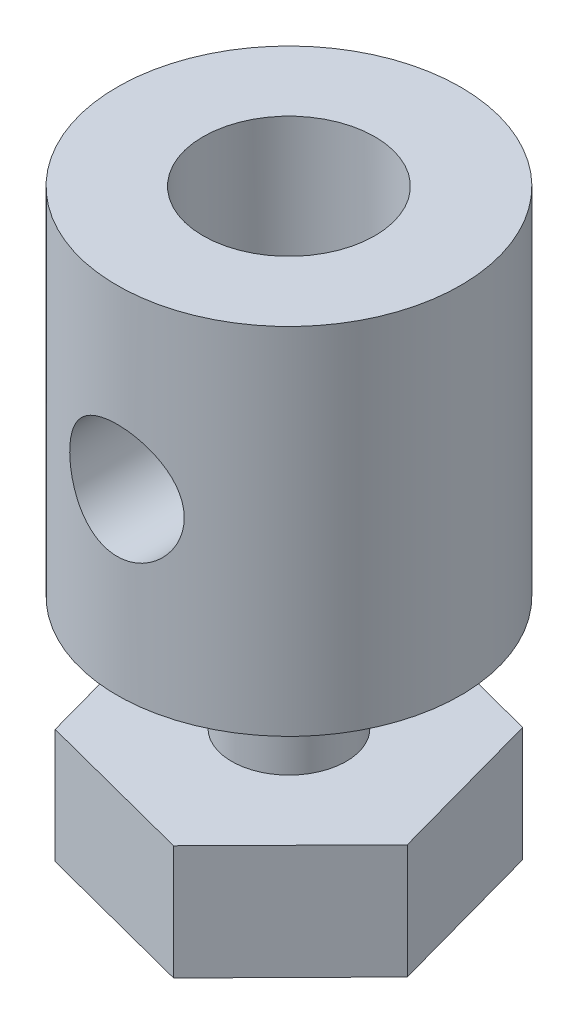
from build123d import *

# Parameters (mm, degrees)
ENL_V_MAT_EXTRU_1_DEPTH      = 12.976643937
ENL_V_MAT_EXTRU_1_DEPTH_BACK = 12.976643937
ESQUISSE2_R                  = 1
BOSS_EXTRU_1_DEPTH           = 2


with BuildPart() as part:
    # Esquisse1 → R_volution1 (revolve)
    with BuildSketch(Plane.XY, mode=Mode.PRIVATE) as r_volution1_sk:
        Polygon((0, 0), (0, 7.2), (1.5, 7.2), (1.5, 11.2), (3, 11.2), (3, 5), (1, 5), (1, 0), align=None)
    revolve(r_volution1_sk.sketch.rotate(Axis((0, 0, 0), (0, 1, 0)), 90), axis=Axis((0, 0, 0), (0, 1, 0)))

    # Esquisse2 → Enl_v. mat.-Extru.1 (cut, two sides: drawn at the far end of the back side and taken through both)
    with BuildSketch(Plane.XY.offset(-ENL_V_MAT_EXTRU_1_DEPTH_BACK)):
        with Locations((0, 8.1)):
            Circle(ESQUISSE2_R)
    extrude(amount=ENL_V_MAT_EXTRU_1_DEPTH + ENL_V_MAT_EXTRU_1_DEPTH_BACK, mode=Mode.SUBTRACT)

    # Esquisse3 → Boss.-Extru.1 (add)
    with BuildSketch(Plane.XZ.offset(-3)):
        Polygon((2.793775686, 0.72673981), (0.767512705, 2.782850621), (-2.02626298, 2.056110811), (-2.793775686, -0.72673981), (-0.767512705, -2.782850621), (2.02626298, -2.056110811), align=None)
    extrude(amount=BOSS_EXTRU_1_DEPTH)


solid = part.part
